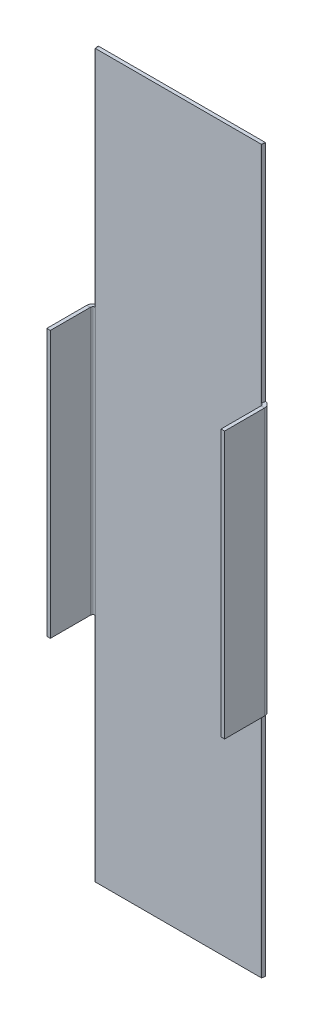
ISO-10303-21;
HEADER;
FILE_DESCRIPTION(('STEP AP214'),'2;1');
FILE_NAME('part.step','',(''),(''),'','','');
FILE_SCHEMA(('AUTOMOTIVE_DESIGN { 1 0 10303 214 1 1 1 1 }'));
ENDSEC;
DATA;
#1=APPLICATION_CONTEXT('core data for automotive mechanical design processes');
#2=APPLICATION_PROTOCOL_DEFINITION('international standard','automotive_design',2000,#1);
#3=PRODUCT_CONTEXT('',#1,'mechanical');
#4=PRODUCT('Part','Part','',(#3));
#5=PRODUCT_RELATED_PRODUCT_CATEGORY('part','',(#4));
#6=PRODUCT_DEFINITION_FORMATION('','',#4);
#7=PRODUCT_DEFINITION_CONTEXT('part definition',#1,'design');
#8=PRODUCT_DEFINITION('design','',#6,#7);
#9=PRODUCT_DEFINITION_SHAPE('','',#8);
#10=(LENGTH_UNIT() NAMED_UNIT(*) SI_UNIT(.MILLI.,.METRE.));
#11=(NAMED_UNIT(*) PLANE_ANGLE_UNIT() SI_UNIT($,.RADIAN.));
#12=(NAMED_UNIT(*) SI_UNIT($,.STERADIAN.) SOLID_ANGLE_UNIT());
#13=UNCERTAINTY_MEASURE_WITH_UNIT(LENGTH_MEASURE(1.E-05),#10,'distance_accuracy_value','');
#14=(GEOMETRIC_REPRESENTATION_CONTEXT(3) GLOBAL_UNCERTAINTY_ASSIGNED_CONTEXT((#13)) GLOBAL_UNIT_ASSIGNED_CONTEXT((#10,
#11,#12)) REPRESENTATION_CONTEXT('',''));
#15=CARTESIAN_POINT('',(0.,0.,0.));
#16=DIRECTION('',(0.,0.,1.));
#17=DIRECTION('',(1.,0.,0.));
#18=AXIS2_PLACEMENT_3D('',#15,#16,#17);
#19=CARTESIAN_POINT('',(-398.2634,6.00000000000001,1.73659999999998));
#20=DIRECTION('',(0.,-1.,0.));
#21=DIRECTION('',(-1.,0.,0.));
#22=AXIS2_PLACEMENT_3D('',#19,#20,#21);
#23=CYLINDRICAL_SURFACE('',#22,1.73659999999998);
#24=DIRECTION('',(0.,-1.,0.));
#25=VECTOR('',#24,1.);
#26=CARTESIAN_POINT('',(-400.,209.,1.73659999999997));
#27=LINE('',#26,#25);
#28=CARTESIAN_POINT('',(-400.,71.,1.73659999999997));
#29=VERTEX_POINT('',#28);
#30=CARTESIAN_POINT('',(-400.,146.,1.73659999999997));
#31=VERTEX_POINT('',#30);
#32=EDGE_CURVE('E355',#29,#31,#27,.F.);
#33=ORIENTED_EDGE('',*,*,#32,.T.);
#34=CARTESIAN_POINT('',(-398.2634,146.,1.73659999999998));
#35=DIRECTION('',(0.,-1.,0.));
#36=DIRECTION('',(0.,0.,-1.));
#37=AXIS2_PLACEMENT_3D('',#34,#35,#36);
#38=CIRCLE('',#37,1.73659999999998);
#39=CARTESIAN_POINT('',(-398.548580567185,146.,0.0235758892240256));
#40=VERTEX_POINT('',#39);
#41=EDGE_CURVE('E219',#40,#31,#38,.F.);
#42=ORIENTED_EDGE('',*,*,#41,.F.);
#43=DIRECTION('',(0.,-1.,0.));
#44=VECTOR('',#43,1.);
#45=CARTESIAN_POINT('',(-398.548580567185,6.00000000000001,0.0235758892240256));
#46=LINE('',#45,#44);
#47=CARTESIAN_POINT('',(-398.548580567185,209.,0.0235758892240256));
#48=VERTEX_POINT('',#47);
#49=EDGE_CURVE('E213',#40,#48,#46,.F.);
#50=ORIENTED_EDGE('',*,*,#49,.T.);
#51=CARTESIAN_POINT('',(-398.2634,209.,1.73659999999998));
#52=DIRECTION('',(0.,-1.,0.));
#53=DIRECTION('',(0.,0.,-1.));
#54=AXIS2_PLACEMENT_3D('',#51,#52,#53);
#55=CIRCLE('',#54,1.73659999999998);
#56=CARTESIAN_POINT('',(-398.2634,209.,0.));
#57=VERTEX_POINT('',#56);
#58=EDGE_CURVE('E227',#57,#48,#55,.F.);
#59=ORIENTED_EDGE('',*,*,#58,.F.);
#60=DIRECTION('',(0.,-1.,0.));
#61=VECTOR('',#60,1.);
#62=CARTESIAN_POINT('',(-398.2634,6.00000000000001,0.));
#63=LINE('',#62,#61);
#64=CARTESIAN_POINT('',(-398.2634,6.,0.));
#65=VERTEX_POINT('',#64);
#66=EDGE_CURVE('E235',#65,#57,#63,.F.);
#67=ORIENTED_EDGE('',*,*,#66,.F.);
#68=CARTESIAN_POINT('',(-398.2634,6.,1.73659999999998));
#69=DIRECTION('',(0.,-1.,0.));
#70=DIRECTION('',(0.,0.,-1.));
#71=AXIS2_PLACEMENT_3D('',#68,#69,#70);
#72=CIRCLE('',#71,1.73659999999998);
#73=CARTESIAN_POINT('',(-398.548580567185,6.,0.0235758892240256));
#74=VERTEX_POINT('',#73);
#75=EDGE_CURVE('E239',#74,#65,#72,.T.);
#76=ORIENTED_EDGE('',*,*,#75,.F.);
#77=DIRECTION('',(0.,-1.,0.));
#78=VECTOR('',#77,1.);
#79=CARTESIAN_POINT('',(-398.548580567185,6.00000000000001,0.0235758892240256));
#80=LINE('',#79,#78);
#81=CARTESIAN_POINT('',(-398.548580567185,71.,0.0235758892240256));
#82=VERTEX_POINT('',#81);
#83=EDGE_CURVE('E294',#82,#74,#80,.T.);
#84=ORIENTED_EDGE('',*,*,#83,.F.);
#85=CARTESIAN_POINT('',(-398.2634,71.,1.73659999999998));
#86=DIRECTION('',(0.,1.,0.));
#87=DIRECTION('',(0.,0.,1.));
#88=AXIS2_PLACEMENT_3D('',#85,#86,#87);
#89=CIRCLE('',#88,1.73659999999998);
#90=EDGE_CURVE('E306',#29,#82,#89,.F.);
#91=ORIENTED_EDGE('',*,*,#90,.F.);
#92=EDGE_LOOP('',(#33,#42,#50,#59,#67,#76,#84,#91));
#93=FACE_BOUND('',#92,.T.);
#94=ADVANCED_FACE('F73',(#93),#23,.T.);
#95=CARTESIAN_POINT('',(-398.2634,6.00000000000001,1.73659999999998));
#96=DIRECTION('',(0.,-1.,0.));
#97=DIRECTION('',(-1.,0.,0.));
#98=AXIS2_PLACEMENT_3D('',#95,#96,#97);
#99=CYLINDRICAL_SURFACE('',#98,0.736599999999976);
#100=CARTESIAN_POINT('',(-398.2634,146.,1.73659999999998));
#101=DIRECTION('',(0.,-1.,0.));
#102=DIRECTION('',(0.,0.,-1.));
#103=AXIS2_PLACEMENT_3D('',#100,#101,#102);
#104=CIRCLE('',#103,0.736599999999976);
#105=CARTESIAN_POINT('',(-398.384362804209,146.,1.01000000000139));
#106=VERTEX_POINT('',#105);
#107=CARTESIAN_POINT('',(-399.,146.,1.73659999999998));
#108=VERTEX_POINT('',#107);
#109=EDGE_CURVE('E357',#106,#108,#104,.F.);
#110=ORIENTED_EDGE('',*,*,#109,.T.);
#111=DIRECTION('',(0.,-1.,0.));
#112=VECTOR('',#111,1.);
#113=CARTESIAN_POINT('',(-399.,209.,1.73659999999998));
#114=LINE('',#113,#112);
#115=CARTESIAN_POINT('',(-399.,71.,1.73659999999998));
#116=VERTEX_POINT('',#115);
#117=EDGE_CURVE('E348',#108,#116,#114,.T.);
#118=ORIENTED_EDGE('',*,*,#117,.T.);
#119=CARTESIAN_POINT('',(-398.2634,71.,1.73659999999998));
#120=DIRECTION('',(0.,-1.,0.));
#121=DIRECTION('',(0.,0.,-1.));
#122=AXIS2_PLACEMENT_3D('',#119,#120,#121);
#123=CIRCLE('',#122,0.736599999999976);
#124=CARTESIAN_POINT('',(-398.384362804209,71.,1.01000000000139));
#125=VERTEX_POINT('',#124);
#126=EDGE_CURVE('E290',#116,#125,#123,.T.);
#127=ORIENTED_EDGE('',*,*,#126,.T.);
#128=DIRECTION('',(0.,-1.,0.));
#129=VECTOR('',#128,1.);
#130=CARTESIAN_POINT('',(-398.384362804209,6.00000000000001,1.01000000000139));
#131=LINE('',#130,#129);
#132=CARTESIAN_POINT('',(-398.384362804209,6.,1.01000000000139));
#133=VERTEX_POINT('',#132);
#134=EDGE_CURVE('E288',#125,#133,#131,.T.);
#135=ORIENTED_EDGE('',*,*,#134,.T.);
#136=CARTESIAN_POINT('',(-398.2634,6.,1.73659999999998));
#137=DIRECTION('',(0.,-1.,0.));
#138=DIRECTION('',(0.,0.,-1.));
#139=AXIS2_PLACEMENT_3D('',#136,#137,#138);
#140=CIRCLE('',#139,0.736599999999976);
#141=CARTESIAN_POINT('',(-398.2634,6.,1.));
#142=VERTEX_POINT('',#141);
#143=EDGE_CURVE('E249',#133,#142,#140,.T.);
#144=ORIENTED_EDGE('',*,*,#143,.T.);
#145=DIRECTION('',(0.,-1.,0.));
#146=VECTOR('',#145,1.);
#147=CARTESIAN_POINT('',(-398.2634,6.00000000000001,1.));
#148=LINE('',#147,#146);
#149=CARTESIAN_POINT('',(-398.2634,209.,1.));
#150=VERTEX_POINT('',#149);
#151=EDGE_CURVE('E246',#142,#150,#148,.F.);
#152=ORIENTED_EDGE('',*,*,#151,.T.);
#153=CARTESIAN_POINT('',(-398.2634,209.,1.73659999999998));
#154=DIRECTION('',(0.,-1.,0.));
#155=DIRECTION('',(0.,0.,-1.));
#156=AXIS2_PLACEMENT_3D('',#153,#154,#155);
#157=CIRCLE('',#156,0.736599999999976);
#158=CARTESIAN_POINT('',(-398.384362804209,209.,1.01000000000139));
#159=VERTEX_POINT('',#158);
#160=EDGE_CURVE('E244',#150,#159,#157,.F.);
#161=ORIENTED_EDGE('',*,*,#160,.T.);
#162=DIRECTION('',(0.,-1.,0.));
#163=VECTOR('',#162,1.);
#164=CARTESIAN_POINT('',(-398.384362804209,6.00000000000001,1.01000000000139));
#165=LINE('',#164,#163);
#166=EDGE_CURVE('E90',#106,#159,#165,.F.);
#167=ORIENTED_EDGE('',*,*,#166,.F.);
#168=EDGE_LOOP('',(#110,#118,#127,#135,#144,#152,#161,#167));
#169=FACE_BOUND('',#168,.T.);
#170=ADVANCED_FACE('F285',(#169),#99,.F.);
#171=CARTESIAN_POINT('',(-400.,6.,0.999999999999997));
#172=DIRECTION('',(1.,0.,0.));
#173=DIRECTION('',(0.,0.,-1.));
#174=AXIS2_PLACEMENT_3D('',#171,#172,#173);
#175=PLANE('',#174);
#176=DIRECTION('',(0.,0.,-1.));
#177=VECTOR('',#176,1.);
#178=CARTESIAN_POINT('',(-400.,146.,0.999999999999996));
#179=LINE('',#178,#177);
#180=CARTESIAN_POINT('',(-400.,146.,13.));
#181=VERTEX_POINT('',#180);
#182=EDGE_CURVE('E380',#181,#31,#179,.T.);
#183=ORIENTED_EDGE('',*,*,#182,.T.);
#184=ORIENTED_EDGE('',*,*,#32,.F.);
#185=DIRECTION('',(0.,0.,1.));
#186=VECTOR('',#185,1.);
#187=CARTESIAN_POINT('',(-400.,71.,1.01000000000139));
#188=LINE('',#187,#186);
#189=CARTESIAN_POINT('',(-400.,71.,13.));
#190=VERTEX_POINT('',#189);
#191=EDGE_CURVE('E309',#29,#190,#188,.T.);
#192=ORIENTED_EDGE('',*,*,#191,.T.);
#193=DIRECTION('',(0.,1.,0.));
#194=VECTOR('',#193,1.);
#195=CARTESIAN_POINT('',(-400.,6.,13.));
#196=LINE('',#195,#194);
#197=EDGE_CURVE('E251',#190,#181,#196,.T.);
#198=ORIENTED_EDGE('',*,*,#197,.T.);
#199=EDGE_LOOP('',(#183,#184,#192,#198));
#200=FACE_BOUND('',#199,.T.);
#201=ADVANCED_FACE('F379',(#200),#175,.F.);
#202=CARTESIAN_POINT('',(-399.,6.,1.));
#203=DIRECTION('',(1.,0.,0.));
#204=DIRECTION('',(0.,0.,-1.));
#205=AXIS2_PLACEMENT_3D('',#202,#203,#204);
#206=PLANE('',#205);
#207=ORIENTED_EDGE('',*,*,#117,.F.);
#208=DIRECTION('',(0.,0.,-1.));
#209=VECTOR('',#208,1.);
#210=CARTESIAN_POINT('',(-399.,146.,1.));
#211=LINE('',#210,#209);
#212=CARTESIAN_POINT('',(-399.,146.,13.));
#213=VERTEX_POINT('',#212);
#214=EDGE_CURVE('E370',#213,#108,#211,.T.);
#215=ORIENTED_EDGE('',*,*,#214,.F.);
#216=DIRECTION('',(0.,-1.,0.));
#217=VECTOR('',#216,1.);
#218=CARTESIAN_POINT('',(-399.,209.,13.));
#219=LINE('',#218,#217);
#220=CARTESIAN_POINT('',(-399.,71.,13.));
#221=VERTEX_POINT('',#220);
#222=EDGE_CURVE('E352',#221,#213,#219,.F.);
#223=ORIENTED_EDGE('',*,*,#222,.F.);
#224=DIRECTION('',(0.,0.,-1.));
#225=VECTOR('',#224,1.);
#226=CARTESIAN_POINT('',(-399.,71.,1.));
#227=LINE('',#226,#225);
#228=EDGE_CURVE('E311',#116,#221,#227,.F.);
#229=ORIENTED_EDGE('',*,*,#228,.F.);
#230=EDGE_LOOP('',(#207,#215,#223,#229));
#231=FACE_BOUND('',#230,.T.);
#232=ADVANCED_FACE('F368',(#231),#206,.T.);
#233=CARTESIAN_POINT('',(-400.,209.,13.));
#234=DIRECTION('',(0.,0.,-1.));
#235=DIRECTION('',(-1.,0.,0.));
#236=AXIS2_PLACEMENT_3D('',#233,#234,#235);
#237=PLANE('',#236);
#238=DIRECTION('',(1.,0.,0.));
#239=VECTOR('',#238,1.);
#240=CARTESIAN_POINT('',(-399.,146.,13.));
#241=LINE('',#240,#239);
#242=EDGE_CURVE('E375',#213,#181,#241,.F.);
#243=ORIENTED_EDGE('',*,*,#242,.T.);
#244=ORIENTED_EDGE('',*,*,#197,.F.);
#245=DIRECTION('',(-1.,0.,0.));
#246=VECTOR('',#245,1.);
#247=CARTESIAN_POINT('',(-400.,71.,13.));
#248=LINE('',#247,#246);
#249=EDGE_CURVE('E316',#190,#221,#248,.F.);
#250=ORIENTED_EDGE('',*,*,#249,.T.);
#251=ORIENTED_EDGE('',*,*,#222,.T.);
#252=EDGE_LOOP('',(#243,#244,#250,#251));
#253=FACE_BOUND('',#252,.T.);
#254=ADVANCED_FACE('F373',(#253),#237,.F.);
#255=CARTESIAN_POINT('',(-398.2634,209.,1.73659999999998));
#256=DIRECTION('',(0.,1.,0.));
#257=DIRECTION('',(0.,0.,1.));
#258=AXIS2_PLACEMENT_3D('',#255,#256,#257);
#259=PLANE('',#258);
#260=ORIENTED_EDGE('',*,*,#58,.T.);
#261=DIRECTION('',(0.164217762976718,0.,0.986424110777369));
#262=VECTOR('',#261,1.);
#263=CARTESIAN_POINT('',(-398.384362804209,209.,1.01000000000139));
#264=LINE('',#263,#262);
#265=EDGE_CURVE('E210',#159,#48,#264,.F.);
#266=ORIENTED_EDGE('',*,*,#265,.F.);
#267=ORIENTED_EDGE('',*,*,#160,.F.);
#268=DIRECTION('',(0.,0.,-1.));
#269=VECTOR('',#268,1.);
#270=CARTESIAN_POINT('',(-398.2634,209.,1.));
#271=LINE('',#270,#269);
#272=EDGE_CURVE('E232',#150,#57,#271,.T.);
#273=ORIENTED_EDGE('',*,*,#272,.T.);
#274=EDGE_LOOP('',(#260,#266,#267,#273));
#275=FACE_BOUND('',#274,.T.);
#276=ADVANCED_FACE('F230',(#275),#259,.T.);
#277=CARTESIAN_POINT('',(-351.7366,209.,1.73659999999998));
#278=DIRECTION('',(0.,1.,0.));
#279=DIRECTION('',(1.,0.,0.));
#280=AXIS2_PLACEMENT_3D('',#277,#278,#279);
#281=CYLINDRICAL_SURFACE('',#280,1.73659999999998);
#282=DIRECTION('',(0.,1.,0.));
#283=VECTOR('',#282,1.);
#284=CARTESIAN_POINT('',(-350.,6.,1.73659999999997));
#285=LINE('',#284,#283);
#286=CARTESIAN_POINT('',(-350.,146.,1.73659999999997));
#287=VERTEX_POINT('',#286);
#288=CARTESIAN_POINT('',(-350.,71.,1.73659999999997));
#289=VERTEX_POINT('',#288);
#290=EDGE_CURVE('E329',#287,#289,#285,.F.);
#291=ORIENTED_EDGE('',*,*,#290,.T.);
#292=CARTESIAN_POINT('',(-351.7366,71.,1.73659999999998));
#293=DIRECTION('',(0.,1.,0.));
#294=DIRECTION('',(0.,0.,1.));
#295=AXIS2_PLACEMENT_3D('',#292,#293,#294);
#296=CIRCLE('',#295,1.73659999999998);
#297=CARTESIAN_POINT('',(-351.451419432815,71.,0.0235758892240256));
#298=VERTEX_POINT('',#297);
#299=EDGE_CURVE('E721',#298,#289,#296,.F.);
#300=ORIENTED_EDGE('',*,*,#299,.F.);
#301=DIRECTION('',(0.,1.,0.));
#302=VECTOR('',#301,1.);
#303=CARTESIAN_POINT('',(-351.451419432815,209.,0.0235758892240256));
#304=LINE('',#303,#302);
#305=CARTESIAN_POINT('',(-351.451419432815,6.00000000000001,0.0235758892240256));
#306=VERTEX_POINT('',#305);
#307=EDGE_CURVE('E711',#306,#298,#304,.T.);
#308=ORIENTED_EDGE('',*,*,#307,.F.);
#309=CARTESIAN_POINT('',(-351.7366,6.00000000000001,1.73659999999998));
#310=DIRECTION('',(0.,1.,0.));
#311=DIRECTION('',(0.,0.,1.));
#312=AXIS2_PLACEMENT_3D('',#309,#310,#311);
#313=CIRCLE('',#312,1.73659999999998);
#314=CARTESIAN_POINT('',(-351.7366,6.,0.));
#315=VERTEX_POINT('',#314);
#316=EDGE_CURVE('E334',#315,#306,#313,.F.);
#317=ORIENTED_EDGE('',*,*,#316,.F.);
#318=DIRECTION('',(0.,1.,0.));
#319=VECTOR('',#318,1.);
#320=CARTESIAN_POINT('',(-351.7366,209.,0.));
#321=LINE('',#320,#319);
#322=CARTESIAN_POINT('',(-351.7366,209.,0.));
#323=VERTEX_POINT('',#322);
#324=EDGE_CURVE('E270',#323,#315,#321,.F.);
#325=ORIENTED_EDGE('',*,*,#324,.F.);
#326=CARTESIAN_POINT('',(-351.7366,209.,1.73659999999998));
#327=DIRECTION('',(0.,1.,0.));
#328=DIRECTION('',(0.,0.,1.));
#329=AXIS2_PLACEMENT_3D('',#326,#327,#328);
#330=CIRCLE('',#329,1.73659999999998);
#331=CARTESIAN_POINT('',(-351.451419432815,209.,0.0235758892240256));
#332=VERTEX_POINT('',#331);
#333=EDGE_CURVE('E335',#332,#323,#330,.T.);
#334=ORIENTED_EDGE('',*,*,#333,.F.);
#335=DIRECTION('',(0.,1.,0.));
#336=VECTOR('',#335,1.);
#337=CARTESIAN_POINT('',(-351.451419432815,209.,0.0235758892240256));
#338=LINE('',#337,#336);
#339=CARTESIAN_POINT('',(-351.451419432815,146.,0.0235758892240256));
#340=VERTEX_POINT('',#339);
#341=EDGE_CURVE('E741',#332,#340,#338,.F.);
#342=ORIENTED_EDGE('',*,*,#341,.T.);
#343=CARTESIAN_POINT('',(-351.7366,146.,1.73659999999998));
#344=DIRECTION('',(0.,-1.,0.));
#345=DIRECTION('',(0.,0.,-1.));
#346=AXIS2_PLACEMENT_3D('',#343,#344,#345);
#347=CIRCLE('',#346,1.73659999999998);
#348=EDGE_CURVE('E751',#287,#340,#347,.F.);
#349=ORIENTED_EDGE('',*,*,#348,.F.);
#350=EDGE_LOOP('',(#291,#300,#308,#317,#325,#334,#342,#349));
#351=FACE_BOUND('',#350,.T.);
#352=ADVANCED_FACE('F404',(#351),#281,.T.);
#353=CARTESIAN_POINT('',(-351.7366,209.,1.73659999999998));
#354=DIRECTION('',(0.,1.,0.));
#355=DIRECTION('',(1.,0.,0.));
#356=AXIS2_PLACEMENT_3D('',#353,#354,#355);
#357=CYLINDRICAL_SURFACE('',#356,0.736599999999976);
#358=CARTESIAN_POINT('',(-351.7366,71.,1.73659999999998));
#359=DIRECTION('',(0.,1.,0.));
#360=DIRECTION('',(0.,0.,1.));
#361=AXIS2_PLACEMENT_3D('',#358,#359,#360);
#362=CIRCLE('',#361,0.736599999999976);
#363=CARTESIAN_POINT('',(-351.615637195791,71.,1.01000000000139));
#364=VERTEX_POINT('',#363);
#365=CARTESIAN_POINT('',(-351.,71.,1.73659999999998));
#366=VERTEX_POINT('',#365);
#367=EDGE_CURVE('E724',#364,#366,#362,.F.);
#368=ORIENTED_EDGE('',*,*,#367,.T.);
#369=DIRECTION('',(0.,1.,0.));
#370=VECTOR('',#369,1.);
#371=CARTESIAN_POINT('',(-351.,6.,1.73659999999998));
#372=LINE('',#371,#370);
#373=CARTESIAN_POINT('',(-351.,146.,1.73659999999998));
#374=VERTEX_POINT('',#373);
#375=EDGE_CURVE('E319',#366,#374,#372,.T.);
#376=ORIENTED_EDGE('',*,*,#375,.T.);
#377=CARTESIAN_POINT('',(-351.7366,146.,1.73659999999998));
#378=DIRECTION('',(0.,1.,0.));
#379=DIRECTION('',(0.,0.,1.));
#380=AXIS2_PLACEMENT_3D('',#377,#378,#379);
#381=CIRCLE('',#380,0.736599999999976);
#382=CARTESIAN_POINT('',(-351.615637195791,146.,1.01000000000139));
#383=VERTEX_POINT('',#382);
#384=EDGE_CURVE('E752',#374,#383,#381,.T.);
#385=ORIENTED_EDGE('',*,*,#384,.T.);
#386=DIRECTION('',(0.,1.,0.));
#387=VECTOR('',#386,1.);
#388=CARTESIAN_POINT('',(-351.615637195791,209.,1.01000000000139));
#389=LINE('',#388,#387);
#390=CARTESIAN_POINT('',(-351.615637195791,209.,1.01000000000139));
#391=VERTEX_POINT('',#390);
#392=EDGE_CURVE('E738',#391,#383,#389,.F.);
#393=ORIENTED_EDGE('',*,*,#392,.F.);
#394=CARTESIAN_POINT('',(-351.7366,209.,1.73659999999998));
#395=DIRECTION('',(0.,1.,0.));
#396=DIRECTION('',(0.,0.,1.));
#397=AXIS2_PLACEMENT_3D('',#394,#395,#396);
#398=CIRCLE('',#397,0.736599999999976);
#399=CARTESIAN_POINT('',(-351.7366,209.,1.));
#400=VERTEX_POINT('',#399);
#401=EDGE_CURVE('E325',#391,#400,#398,.T.);
#402=ORIENTED_EDGE('',*,*,#401,.T.);
#403=DIRECTION('',(0.,1.,0.));
#404=VECTOR('',#403,1.);
#405=CARTESIAN_POINT('',(-351.7366,209.,1.));
#406=LINE('',#405,#404);
#407=CARTESIAN_POINT('',(-351.7366,6.00000000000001,1.));
#408=VERTEX_POINT('',#407);
#409=EDGE_CURVE('E342',#400,#408,#406,.F.);
#410=ORIENTED_EDGE('',*,*,#409,.T.);
#411=CARTESIAN_POINT('',(-351.7366,6.00000000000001,1.73659999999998));
#412=DIRECTION('',(0.,1.,0.));
#413=DIRECTION('',(0.,0.,1.));
#414=AXIS2_PLACEMENT_3D('',#411,#412,#413);
#415=CIRCLE('',#414,0.736599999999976);
#416=CARTESIAN_POINT('',(-351.615637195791,6.00000000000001,1.01000000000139));
#417=VERTEX_POINT('',#416);
#418=EDGE_CURVE('E339',#408,#417,#415,.F.);
#419=ORIENTED_EDGE('',*,*,#418,.T.);
#420=DIRECTION('',(0.,1.,0.));
#421=VECTOR('',#420,1.);
#422=CARTESIAN_POINT('',(-351.615637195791,209.,1.01000000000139));
#423=LINE('',#422,#421);
#424=EDGE_CURVE('E98',#417,#364,#423,.T.);
#425=ORIENTED_EDGE('',*,*,#424,.T.);
#426=EDGE_LOOP('',(#368,#376,#385,#393,#402,#410,#419,#425));
#427=FACE_BOUND('',#426,.T.);
#428=ADVANCED_FACE('F460',(#427),#357,.F.);
#429=CARTESIAN_POINT('',(-350.,6.,13.));
#430=DIRECTION('',(-1.,0.,0.));
#431=DIRECTION('',(0.,0.,1.));
#432=AXIS2_PLACEMENT_3D('',#429,#430,#431);
#433=PLANE('',#432);
#434=DIRECTION('',(0.,0.,1.));
#435=VECTOR('',#434,1.);
#436=CARTESIAN_POINT('',(-350.,71.,13.));
#437=LINE('',#436,#435);
#438=CARTESIAN_POINT('',(-350.,71.,13.));
#439=VERTEX_POINT('',#438);
#440=EDGE_CURVE('E729',#439,#289,#437,.F.);
#441=ORIENTED_EDGE('',*,*,#440,.T.);
#442=ORIENTED_EDGE('',*,*,#290,.F.);
#443=DIRECTION('',(0.,0.,1.));
#444=VECTOR('',#443,1.);
#445=CARTESIAN_POINT('',(-350.,146.,1.01000000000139));
#446=LINE('',#445,#444);
#447=CARTESIAN_POINT('',(-350.,146.,13.));
#448=VERTEX_POINT('',#447);
#449=EDGE_CURVE('E755',#287,#448,#446,.T.);
#450=ORIENTED_EDGE('',*,*,#449,.T.);
#451=DIRECTION('',(0.,-1.,0.));
#452=VECTOR('',#451,1.);
#453=CARTESIAN_POINT('',(-350.,6.,13.));
#454=LINE('',#453,#452);
#455=EDGE_CURVE('E322',#448,#439,#454,.T.);
#456=ORIENTED_EDGE('',*,*,#455,.T.);
#457=EDGE_LOOP('',(#441,#442,#450,#456));
#458=FACE_BOUND('',#457,.T.);
#459=ADVANCED_FACE('F452',(#458),#433,.F.);
#460=CARTESIAN_POINT('',(-351.,6.,13.));
#461=DIRECTION('',(-1.,0.,0.));
#462=DIRECTION('',(0.,0.,1.));
#463=AXIS2_PLACEMENT_3D('',#460,#461,#462);
#464=PLANE('',#463);
#465=ORIENTED_EDGE('',*,*,#375,.F.);
#466=DIRECTION('',(0.,0.,-1.));
#467=VECTOR('',#466,1.);
#468=CARTESIAN_POINT('',(-351.,71.,13.));
#469=LINE('',#468,#467);
#470=CARTESIAN_POINT('',(-351.,71.,13.));
#471=VERTEX_POINT('',#470);
#472=EDGE_CURVE('E727',#471,#366,#469,.T.);
#473=ORIENTED_EDGE('',*,*,#472,.F.);
#474=DIRECTION('',(0.,1.,0.));
#475=VECTOR('',#474,1.);
#476=CARTESIAN_POINT('',(-351.,6.,13.));
#477=LINE('',#476,#475);
#478=CARTESIAN_POINT('',(-351.,146.,13.));
#479=VERTEX_POINT('',#478);
#480=EDGE_CURVE('E326',#479,#471,#477,.F.);
#481=ORIENTED_EDGE('',*,*,#480,.F.);
#482=DIRECTION('',(0.,0.,1.));
#483=VECTOR('',#482,1.);
#484=CARTESIAN_POINT('',(-351.,146.,13.));
#485=LINE('',#484,#483);
#486=EDGE_CURVE('E757',#374,#479,#485,.T.);
#487=ORIENTED_EDGE('',*,*,#486,.F.);
#488=EDGE_LOOP('',(#465,#473,#481,#487));
#489=FACE_BOUND('',#488,.T.);
#490=ADVANCED_FACE('F444',(#489),#464,.T.);
#491=CARTESIAN_POINT('',(-350.,6.,13.));
#492=DIRECTION('',(0.,0.,-1.));
#493=DIRECTION('',(-1.,0.,0.));
#494=AXIS2_PLACEMENT_3D('',#491,#492,#493);
#495=PLANE('',#494);
#496=DIRECTION('',(-1.,0.,0.));
#497=VECTOR('',#496,1.);
#498=CARTESIAN_POINT('',(-351.,71.,13.));
#499=LINE('',#498,#497);
#500=EDGE_CURVE('E732',#471,#439,#499,.F.);
#501=ORIENTED_EDGE('',*,*,#500,.T.);
#502=ORIENTED_EDGE('',*,*,#455,.F.);
#503=DIRECTION('',(1.,0.,0.));
#504=VECTOR('',#503,1.);
#505=CARTESIAN_POINT('',(-350.,146.,13.));
#506=LINE('',#505,#504);
#507=EDGE_CURVE('E295',#448,#479,#506,.F.);
#508=ORIENTED_EDGE('',*,*,#507,.T.);
#509=ORIENTED_EDGE('',*,*,#480,.T.);
#510=EDGE_LOOP('',(#501,#502,#508,#509));
#511=FACE_BOUND('',#510,.T.);
#512=ADVANCED_FACE('F436',(#511),#495,.F.);
#513=CARTESIAN_POINT('',(-351.7366,6.00000000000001,1.73659999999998));
#514=DIRECTION('',(0.,-1.,0.));
#515=DIRECTION('',(0.,0.,-1.));
#516=AXIS2_PLACEMENT_3D('',#513,#514,#515);
#517=PLANE('',#516);
#518=ORIENTED_EDGE('',*,*,#316,.T.);
#519=DIRECTION('',(-0.164217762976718,0.,0.986424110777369));
#520=VECTOR('',#519,1.);
#521=CARTESIAN_POINT('',(-351.615637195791,6.,1.01000000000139));
#522=LINE('',#521,#520);
#523=EDGE_CURVE('E719',#417,#306,#522,.F.);
#524=ORIENTED_EDGE('',*,*,#523,.F.);
#525=ORIENTED_EDGE('',*,*,#418,.F.);
#526=DIRECTION('',(0.,0.,-1.));
#527=VECTOR('',#526,1.);
#528=CARTESIAN_POINT('',(-351.7366,6.00000000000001,1.));
#529=LINE('',#528,#527);
#530=EDGE_CURVE('E345',#408,#315,#529,.T.);
#531=ORIENTED_EDGE('',*,*,#530,.T.);
#532=EDGE_LOOP('',(#518,#524,#525,#531));
#533=FACE_BOUND('',#532,.T.);
#534=ADVANCED_FACE('F428',(#533),#517,.T.);
#535=CARTESIAN_POINT('',(-351.7366,209.,1.73659999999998));
#536=DIRECTION('',(0.,-1.,0.));
#537=DIRECTION('',(0.,0.,-1.));
#538=AXIS2_PLACEMENT_3D('',#535,#536,#537);
#539=PLANE('',#538);
#540=ORIENTED_EDGE('',*,*,#401,.F.);
#541=DIRECTION('',(-0.164217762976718,0.,0.986424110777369));
#542=VECTOR('',#541,1.);
#543=CARTESIAN_POINT('',(-351.615637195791,209.,1.01000000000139));
#544=LINE('',#543,#542);
#545=EDGE_CURVE('E748',#391,#332,#544,.F.);
#546=ORIENTED_EDGE('',*,*,#545,.T.);
#547=ORIENTED_EDGE('',*,*,#333,.T.);
#548=DIRECTION('',(0.,0.,-1.));
#549=VECTOR('',#548,1.);
#550=CARTESIAN_POINT('',(-351.7366,209.,1.));
#551=LINE('',#550,#549);
#552=EDGE_CURVE('E265',#400,#323,#551,.T.);
#553=ORIENTED_EDGE('',*,*,#552,.F.);
#554=EDGE_LOOP('',(#540,#546,#547,#553));
#555=FACE_BOUND('',#554,.T.);
#556=ADVANCED_FACE('F407',(#555),#539,.F.);
#557=CARTESIAN_POINT('',(-398.2634,6.,1.73659999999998));
#558=DIRECTION('',(0.,1.,0.));
#559=DIRECTION('',(0.,0.,1.));
#560=AXIS2_PLACEMENT_3D('',#557,#558,#559);
#561=PLANE('',#560);
#562=ORIENTED_EDGE('',*,*,#143,.F.);
#563=DIRECTION('',(0.164217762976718,0.,0.986424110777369));
#564=VECTOR('',#563,1.);
#565=CARTESIAN_POINT('',(-398.384362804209,6.,1.01000000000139));
#566=LINE('',#565,#564);
#567=EDGE_CURVE('E304',#133,#74,#566,.F.);
#568=ORIENTED_EDGE('',*,*,#567,.T.);
#569=ORIENTED_EDGE('',*,*,#75,.T.);
#570=DIRECTION('',(0.,0.,-1.));
#571=VECTOR('',#570,1.);
#572=CARTESIAN_POINT('',(-398.2634,6.,1.));
#573=LINE('',#572,#571);
#574=EDGE_CURVE('E234',#142,#65,#573,.T.);
#575=ORIENTED_EDGE('',*,*,#574,.F.);
#576=EDGE_LOOP('',(#562,#568,#569,#575));
#577=FACE_BOUND('',#576,.T.);
#578=ADVANCED_FACE('F278',(#577),#561,.F.);
#579=CARTESIAN_POINT('',(-400.,6.,1.));
#580=DIRECTION('',(0.,1.,0.));
#581=DIRECTION('',(0.,0.,1.));
#582=AXIS2_PLACEMENT_3D('',#579,#580,#581);
#583=PLANE('',#582);
#584=ORIENTED_EDGE('',*,*,#530,.F.);
#585=DIRECTION('',(1.,0.,0.));
#586=VECTOR('',#585,1.);
#587=CARTESIAN_POINT('',(-400.,6.,1.));
#588=LINE('',#587,#586);
#589=EDGE_CURVE('E82',#142,#408,#588,.T.);
#590=ORIENTED_EDGE('',*,*,#589,.F.);
#591=ORIENTED_EDGE('',*,*,#574,.T.);
#592=DIRECTION('',(1.,0.,0.));
#593=VECTOR('',#592,1.);
#594=CARTESIAN_POINT('',(-400.,6.,0.));
#595=LINE('',#594,#593);
#596=EDGE_CURVE('E252',#65,#315,#595,.T.);
#597=ORIENTED_EDGE('',*,*,#596,.T.);
#598=EDGE_LOOP('',(#584,#590,#591,#597));
#599=FACE_BOUND('',#598,.T.);
#600=ADVANCED_FACE('F75',(#599),#583,.F.);
#601=CARTESIAN_POINT('',(-400.,209.,1.));
#602=DIRECTION('',(0.,-1.,0.));
#603=DIRECTION('',(0.,0.,-1.));
#604=AXIS2_PLACEMENT_3D('',#601,#602,#603);
#605=PLANE('',#604);
#606=ORIENTED_EDGE('',*,*,#552,.T.);
#607=DIRECTION('',(-1.,0.,0.));
#608=VECTOR('',#607,1.);
#609=CARTESIAN_POINT('',(-400.,209.,0.));
#610=LINE('',#609,#608);
#611=EDGE_CURVE('E77',#323,#57,#610,.T.);
#612=ORIENTED_EDGE('',*,*,#611,.T.);
#613=ORIENTED_EDGE('',*,*,#272,.F.);
#614=DIRECTION('',(-1.,0.,0.));
#615=VECTOR('',#614,1.);
#616=CARTESIAN_POINT('',(-400.,209.,1.));
#617=LINE('',#616,#615);
#618=EDGE_CURVE('E13',#400,#150,#617,.T.);
#619=ORIENTED_EDGE('',*,*,#618,.F.);
#620=EDGE_LOOP('',(#606,#612,#613,#619));
#621=FACE_BOUND('',#620,.T.);
#622=ADVANCED_FACE('F262',(#621),#605,.F.);
#623=CARTESIAN_POINT('',(-350.,6.00000000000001,1.));
#624=DIRECTION('',(0.,0.,-1.));
#625=DIRECTION('',(-1.,0.,0.));
#626=AXIS2_PLACEMENT_3D('',#623,#624,#625);
#627=PLANE('',#626);
#628=ORIENTED_EDGE('',*,*,#409,.F.);
#629=ORIENTED_EDGE('',*,*,#618,.T.);
#630=ORIENTED_EDGE('',*,*,#151,.F.);
#631=ORIENTED_EDGE('',*,*,#589,.T.);
#632=EDGE_LOOP('',(#628,#629,#630,#631));
#633=FACE_BOUND('',#632,.T.);
#634=ADVANCED_FACE('F282',(#633),#627,.F.);
#635=CARTESIAN_POINT('',(-350.,6.00000000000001,0.));
#636=DIRECTION('',(0.,0.,-1.));
#637=DIRECTION('',(-1.,0.,0.));
#638=AXIS2_PLACEMENT_3D('',#635,#636,#637);
#639=PLANE('',#638);
#640=ORIENTED_EDGE('',*,*,#611,.F.);
#641=ORIENTED_EDGE('',*,*,#324,.T.);
#642=ORIENTED_EDGE('',*,*,#596,.F.);
#643=ORIENTED_EDGE('',*,*,#66,.T.);
#644=EDGE_LOOP('',(#640,#641,#642,#643));
#645=FACE_BOUND('',#644,.T.);
#646=ADVANCED_FACE('F268',(#645),#639,.T.);
#647=CARTESIAN_POINT('',(-400.,71.,1.01000000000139));
#648=DIRECTION('',(0.,1.,0.));
#649=DIRECTION('',(0.,0.,1.));
#650=AXIS2_PLACEMENT_3D('',#647,#648,#649);
#651=PLANE('',#650);
#652=ORIENTED_EDGE('',*,*,#249,.F.);
#653=ORIENTED_EDGE('',*,*,#191,.F.);
#654=DIRECTION('',(-1.,0.,0.));
#655=VECTOR('',#654,1.);
#656=CARTESIAN_POINT('',(-400.,71.,1.73659999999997));
#657=LINE('',#656,#655);
#658=EDGE_CURVE('E313',#29,#116,#657,.F.);
#659=ORIENTED_EDGE('',*,*,#658,.T.);
#660=ORIENTED_EDGE('',*,*,#228,.T.);
#661=EDGE_LOOP('',(#652,#653,#659,#660));
#662=FACE_BOUND('',#661,.T.);
#663=ADVANCED_FACE('F366',(#662),#651,.F.);
#664=CARTESIAN_POINT('',(-398.2634,71.,1.73659999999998));
#665=DIRECTION('',(0.,-1.,0.));
#666=DIRECTION('',(0.,0.,-1.));
#667=AXIS2_PLACEMENT_3D('',#664,#665,#666);
#668=PLANE('',#667);
#669=ORIENTED_EDGE('',*,*,#658,.F.);
#670=ORIENTED_EDGE('',*,*,#90,.T.);
#671=DIRECTION('',(0.164217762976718,0.,0.986424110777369));
#672=VECTOR('',#671,1.);
#673=CARTESIAN_POINT('',(-398.384362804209,71.,1.01000000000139));
#674=LINE('',#673,#672);
#675=EDGE_CURVE('E297',#125,#82,#674,.F.);
#676=ORIENTED_EDGE('',*,*,#675,.F.);
#677=ORIENTED_EDGE('',*,*,#126,.F.);
#678=EDGE_LOOP('',(#669,#670,#676,#677));
#679=FACE_BOUND('',#678,.T.);
#680=ADVANCED_FACE('F363',(#679),#668,.T.);
#681=CARTESIAN_POINT('',(-398.384362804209,38.5,1.01000000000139));
#682=DIRECTION('',(0.986424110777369,0.,-0.164217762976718));
#683=DIRECTION('',(0.,-1.,0.));
#684=AXIS2_PLACEMENT_3D('',#681,#682,#683);
#685=PLANE('',#684);
#686=ORIENTED_EDGE('',*,*,#567,.F.);
#687=ORIENTED_EDGE('',*,*,#134,.F.);
#688=ORIENTED_EDGE('',*,*,#675,.T.);
#689=ORIENTED_EDGE('',*,*,#83,.T.);
#690=EDGE_LOOP('',(#686,#687,#688,#689));
#691=FACE_BOUND('',#690,.T.);
#692=ADVANCED_FACE('F381',(#691),#685,.F.);
#693=CARTESIAN_POINT('',(-350.,146.,1.01000000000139));
#694=DIRECTION('',(0.,-1.,0.));
#695=DIRECTION('',(0.,0.,1.));
#696=AXIS2_PLACEMENT_3D('',#693,#694,#695);
#697=PLANE('',#696);
#698=ORIENTED_EDGE('',*,*,#507,.F.);
#699=ORIENTED_EDGE('',*,*,#449,.F.);
#700=DIRECTION('',(1.,0.,0.));
#701=VECTOR('',#700,1.);
#702=CARTESIAN_POINT('',(-350.,146.,1.73659999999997));
#703=LINE('',#702,#701);
#704=EDGE_CURVE('E300',#287,#374,#703,.F.);
#705=ORIENTED_EDGE('',*,*,#704,.T.);
#706=ORIENTED_EDGE('',*,*,#486,.T.);
#707=EDGE_LOOP('',(#698,#699,#705,#706));
#708=FACE_BOUND('',#707,.T.);
#709=ADVANCED_FACE('F383',(#708),#697,.F.);
#710=CARTESIAN_POINT('',(-351.7366,146.,1.73659999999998));
#711=DIRECTION('',(0.,1.,0.));
#712=DIRECTION('',(0.,0.,1.));
#713=AXIS2_PLACEMENT_3D('',#710,#711,#712);
#714=PLANE('',#713);
#715=ORIENTED_EDGE('',*,*,#348,.T.);
#716=DIRECTION('',(-0.164217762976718,0.,0.986424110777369));
#717=VECTOR('',#716,1.);
#718=CARTESIAN_POINT('',(-351.615637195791,146.,1.01000000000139));
#719=LINE('',#718,#717);
#720=EDGE_CURVE('E744',#383,#340,#719,.F.);
#721=ORIENTED_EDGE('',*,*,#720,.F.);
#722=ORIENTED_EDGE('',*,*,#384,.F.);
#723=ORIENTED_EDGE('',*,*,#704,.F.);
#724=EDGE_LOOP('',(#715,#721,#722,#723));
#725=FACE_BOUND('',#724,.T.);
#726=ADVANCED_FACE('F389',(#725),#714,.T.);
#727=CARTESIAN_POINT('',(-351.615637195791,177.5,1.01000000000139));
#728=DIRECTION('',(-0.986424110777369,0.,-0.164217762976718));
#729=DIRECTION('',(0.,1.,0.));
#730=AXIS2_PLACEMENT_3D('',#727,#728,#729);
#731=PLANE('',#730);
#732=ORIENTED_EDGE('',*,*,#545,.F.);
#733=ORIENTED_EDGE('',*,*,#392,.T.);
#734=ORIENTED_EDGE('',*,*,#720,.T.);
#735=ORIENTED_EDGE('',*,*,#341,.F.);
#736=EDGE_LOOP('',(#732,#733,#734,#735));
#737=FACE_BOUND('',#736,.T.);
#738=ADVANCED_FACE('F613',(#737),#731,.F.);
#739=CARTESIAN_POINT('',(-351.,71.,13.));
#740=DIRECTION('',(0.,1.,0.));
#741=DIRECTION('',(0.,0.,-1.));
#742=AXIS2_PLACEMENT_3D('',#739,#740,#741);
#743=PLANE('',#742);
#744=ORIENTED_EDGE('',*,*,#472,.T.);
#745=DIRECTION('',(-1.,0.,0.));
#746=VECTOR('',#745,1.);
#747=CARTESIAN_POINT('',(-351.,71.,1.73659999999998));
#748=LINE('',#747,#746);
#749=EDGE_CURVE('E735',#366,#289,#748,.F.);
#750=ORIENTED_EDGE('',*,*,#749,.T.);
#751=ORIENTED_EDGE('',*,*,#440,.F.);
#752=ORIENTED_EDGE('',*,*,#500,.F.);
#753=EDGE_LOOP('',(#744,#750,#751,#752));
#754=FACE_BOUND('',#753,.T.);
#755=ADVANCED_FACE('F623',(#754),#743,.F.);
#756=CARTESIAN_POINT('',(-351.7366,71.,1.73659999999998));
#757=DIRECTION('',(0.,-1.,0.));
#758=DIRECTION('',(0.,0.,-1.));
#759=AXIS2_PLACEMENT_3D('',#756,#757,#758);
#760=PLANE('',#759);
#761=ORIENTED_EDGE('',*,*,#299,.T.);
#762=ORIENTED_EDGE('',*,*,#749,.F.);
#763=ORIENTED_EDGE('',*,*,#367,.F.);
#764=DIRECTION('',(-0.164217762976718,0.,0.986424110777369));
#765=VECTOR('',#764,1.);
#766=CARTESIAN_POINT('',(-351.615637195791,71.,1.01000000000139));
#767=LINE('',#766,#765);
#768=EDGE_CURVE('E717',#364,#298,#767,.F.);
#769=ORIENTED_EDGE('',*,*,#768,.T.);
#770=EDGE_LOOP('',(#761,#762,#763,#769));
#771=FACE_BOUND('',#770,.T.);
#772=ADVANCED_FACE('F633',(#771),#760,.T.);
#773=CARTESIAN_POINT('',(-351.615637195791,38.5,1.01000000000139));
#774=DIRECTION('',(-0.986424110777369,0.,-0.164217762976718));
#775=DIRECTION('',(0.,1.,0.));
#776=AXIS2_PLACEMENT_3D('',#773,#774,#775);
#777=PLANE('',#776);
#778=ORIENTED_EDGE('',*,*,#424,.F.);
#779=ORIENTED_EDGE('',*,*,#523,.T.);
#780=ORIENTED_EDGE('',*,*,#307,.T.);
#781=ORIENTED_EDGE('',*,*,#768,.F.);
#782=EDGE_LOOP('',(#778,#779,#780,#781));
#783=FACE_BOUND('',#782,.T.);
#784=ADVANCED_FACE('F643',(#783),#777,.F.);
#785=CARTESIAN_POINT('',(-399.,146.,1.));
#786=DIRECTION('',(0.,-1.,0.));
#787=DIRECTION('',(0.,0.,-1.));
#788=AXIS2_PLACEMENT_3D('',#785,#786,#787);
#789=PLANE('',#788);
#790=ORIENTED_EDGE('',*,*,#214,.T.);
#791=DIRECTION('',(1.,0.,0.));
#792=VECTOR('',#791,1.);
#793=CARTESIAN_POINT('',(-399.,146.,1.73659999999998));
#794=LINE('',#793,#792);
#795=EDGE_CURVE('E708',#108,#31,#794,.F.);
#796=ORIENTED_EDGE('',*,*,#795,.T.);
#797=ORIENTED_EDGE('',*,*,#182,.F.);
#798=ORIENTED_EDGE('',*,*,#242,.F.);
#799=EDGE_LOOP('',(#790,#796,#797,#798));
#800=FACE_BOUND('',#799,.T.);
#801=ADVANCED_FACE('F653',(#800),#789,.F.);
#802=CARTESIAN_POINT('',(-398.2634,146.,1.73659999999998));
#803=DIRECTION('',(0.,1.,0.));
#804=DIRECTION('',(0.,0.,1.));
#805=AXIS2_PLACEMENT_3D('',#802,#803,#804);
#806=PLANE('',#805);
#807=ORIENTED_EDGE('',*,*,#41,.T.);
#808=ORIENTED_EDGE('',*,*,#795,.F.);
#809=ORIENTED_EDGE('',*,*,#109,.F.);
#810=DIRECTION('',(0.164217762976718,0.,0.986424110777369));
#811=VECTOR('',#810,1.);
#812=CARTESIAN_POINT('',(-398.384362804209,146.,1.01000000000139));
#813=LINE('',#812,#811);
#814=EDGE_CURVE('E220',#106,#40,#813,.F.);
#815=ORIENTED_EDGE('',*,*,#814,.T.);
#816=EDGE_LOOP('',(#807,#808,#809,#815));
#817=FACE_BOUND('',#816,.T.);
#818=ADVANCED_FACE('F662',(#817),#806,.T.);
#819=CARTESIAN_POINT('',(-398.384362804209,177.5,1.01000000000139));
#820=DIRECTION('',(0.986424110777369,0.,-0.164217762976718));
#821=DIRECTION('',(0.,-1.,0.));
#822=AXIS2_PLACEMENT_3D('',#819,#820,#821);
#823=PLANE('',#822);
#824=ORIENTED_EDGE('',*,*,#166,.T.);
#825=ORIENTED_EDGE('',*,*,#265,.T.);
#826=ORIENTED_EDGE('',*,*,#49,.F.);
#827=ORIENTED_EDGE('',*,*,#814,.F.);
#828=EDGE_LOOP('',(#824,#825,#826,#827));
#829=FACE_BOUND('',#828,.T.);
#830=ADVANCED_FACE('F212',(#829),#823,.F.);
#831=CLOSED_SHELL('',(#94,#170,#201,#232,#254,#276,#352,#428,#459,#490,#512,#534,#556,#578,#600,
#622,#634,#646,#663,#680,#692,#709,#726,#738,#755,#772,#784,#801,#818,#830));
#832=MANIFOLD_SOLID_BREP('B2',#831);
#833=ADVANCED_BREP_SHAPE_REPRESENTATION('',(#18,#832),#14);
#834=SHAPE_DEFINITION_REPRESENTATION(#9,#833);
ENDSEC;
END-ISO-10303-21;
